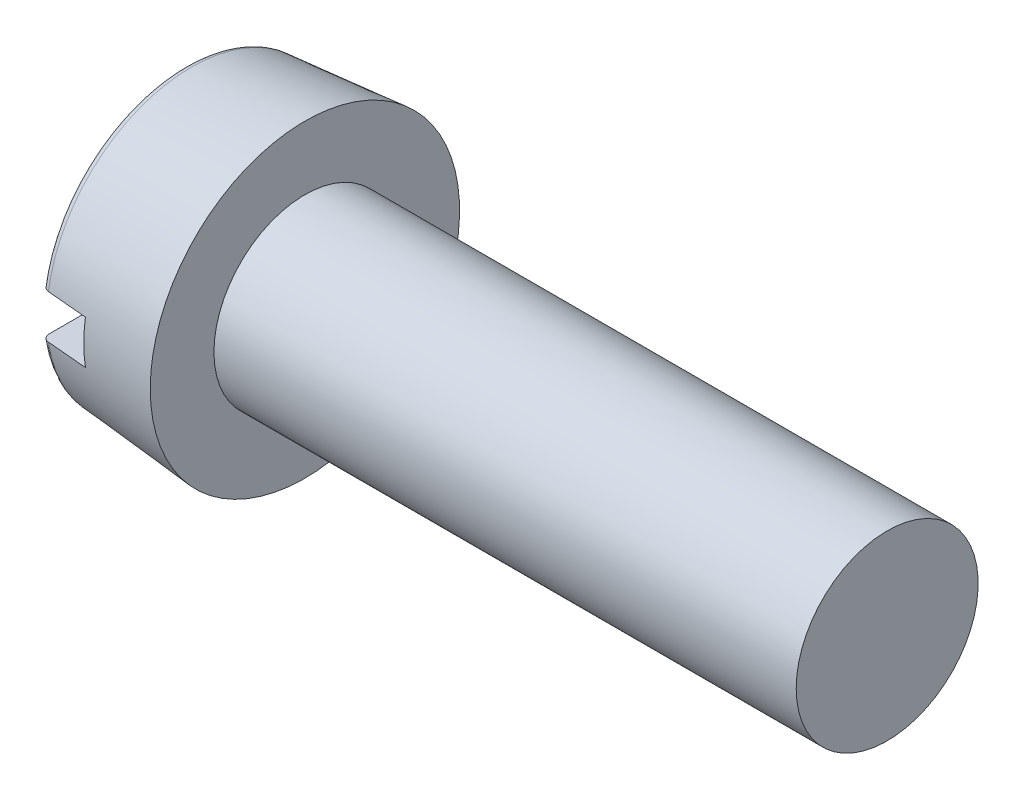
from build123d import *

# Parameters (mm, degrees)
FILLET2_R  = 0.2
SKETCH2_W  = 8.5
SKETCH2_H  = 1.2
SLOT_DEPTH = 1.3


with BuildPart() as part:
    # BodySke → Base-Revolve (revolve)
    with BuildSketch(Plane.XY, mode=Mode.PRIVATE) as base_revolve_sk:
        Polygon((3.3, 2.5), (3.3, 4.25), (0, 3.96128741), (0, 0), (19.3, 0), (19.3, 2.5), align=None)
    revolve(base_revolve_sk.sketch.rotate(Axis((-25.4, 0, 0), (1, 0, 0)), 90), axis=Axis((-25.4, 0, 0), (1, 0, 0)))

    # Fillet2
    fillet2_edges = [part.edges().sort_by_distance(p)[0] for p in [
        (0, 0, -3.96128741),
    ]]
    fillet(fillet2_edges, radius=FILLET2_R)

    # Sketch2 → Slot (cut)
    with BuildSketch(Plane(origin=(0, 0, 0), x_dir=(0, 0, -1), z_dir=(1, 0, 0))):
        Rectangle(SKETCH2_W, SKETCH2_H)
    extrude(amount=SLOT_DEPTH, mode=Mode.SUBTRACT)


solid = part.part
